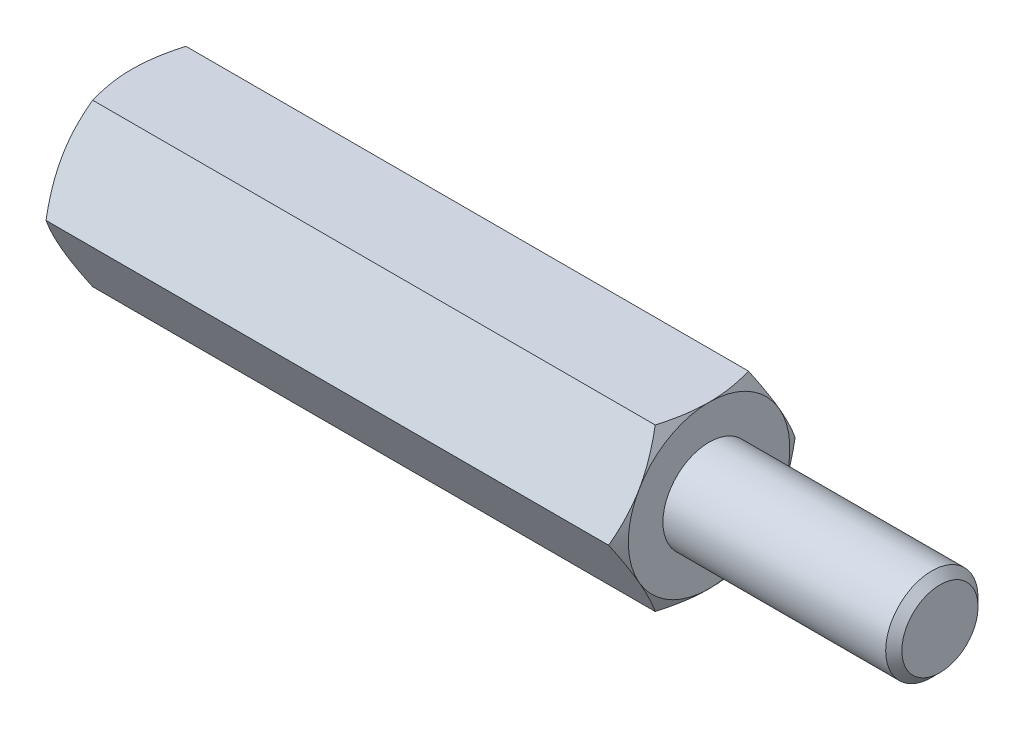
from build123d import *

# Parameters (mm, degrees)
EXTRUDE2_DEPTH = 12.5
SKETCH3_R      = 1.65
EXTRUDE3_DEPTH = 10
SKETCH5_R      = 2
EXTRUDE4_DEPTH = 10
CHAMFER1_SIZE  = 0.35


with BuildPart() as part:
    # Sketch1 → Extrude2 (new, symmetric)
    with BuildSketch(Plane(origin=(0, 0, 0), x_dir=(0, 0, -1), z_dir=(1, 0, 0))):
        Polygon((2.020725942, 3.5), (-2.020725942, 3.5), (-4.041451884, 0), (-2.020725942, -3.5), (2.020725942, -3.5), (4.041451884, 0), align=None)
    extrude(amount=EXTRUDE2_DEPTH, both=True)

    # Sketch2 → Cut-Revolve1 (revolve, cut)
    with BuildSketch(Plane.XY):
        with BuildLine():
            Line((-12.5, 3.5), (-11, 6.098076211))
            ThreePointArc((-11, 6.098076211), (-11.48810136, 7.276457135), (-12.5, 6.5))
            Line((-12.5, 6.5), (-12.5, 3.5))
        make_face()
    cut_revolve1 = revolve(axis=Axis((0, 0, 0), (1, 0, 0)), mode=Mode.SUBTRACT)

    # Mirror1: Cut-Revolve1 across plane
    add(cut_revolve1.mirror(Plane(origin=(0, 0, 0), x_dir=(0, 0, 1), z_dir=(1, 0, 0))), mode=Mode.SUBTRACT)

    # Sketch3 → Extrude3 (cut)
    with BuildSketch(Plane.ZY.offset(12.5)):
        Circle(SKETCH3_R)
    extrude(amount=-EXTRUDE3_DEPTH, mode=Mode.SUBTRACT)

    # Sketch4 → Cut-Revolve2 (revolve, cut)
    with BuildSketch(Plane.XY, mode=Mode.PRIVATE) as cut_revolve2_sk:
        Polygon((-2.5, 0), (-2.5, 1.65), (-1.547372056, 0), align=None)
    revolve(cut_revolve2_sk.sketch.rotate(Axis((-1.547372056, 0, 0), (-1, 0, 0)), 270), axis=Axis((-1.547372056, 0, 0), (-1, 0, 0)), mode=Mode.SUBTRACT)

    # Sketch5 → Extrude4 (add)
    with BuildSketch(Plane(origin=(12.5, 0, 0), x_dir=(0, 0, -1), z_dir=(1, 0, 0))):
        Circle(SKETCH5_R)
    extrude(amount=EXTRUDE4_DEPTH)

    # Chamfer1
    chamfer1_edges = [part.edges().sort_by_distance(p)[0] for p in [
        (22.5, 0, 2),
    ]]
    chamfer(chamfer1_edges, length=CHAMFER1_SIZE)


solid = part.part
